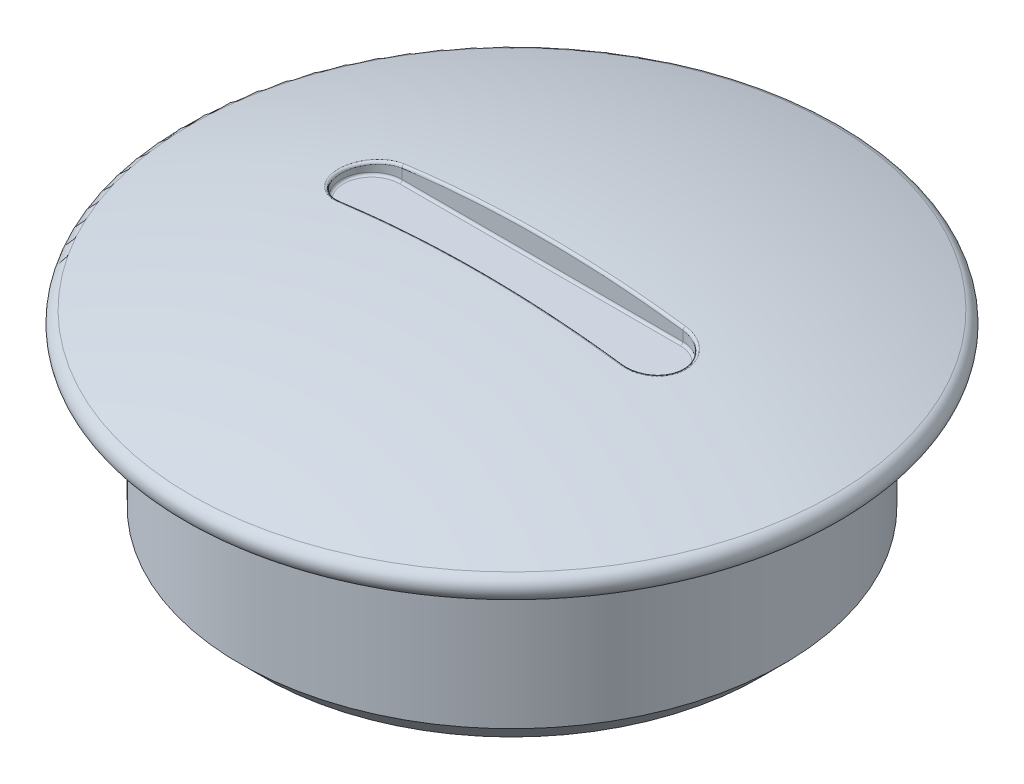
from build123d import *

# Parameters (mm, degrees)
ENL_V_MAT_EXTRU_1_DEPTH = 1
CONG_1_R                = 0.1
CHANFREIN1_SIZE         = 1


with BuildPart() as part:
    # Esquisse1 → R_volution1 (revolve)
    with BuildSketch(Plane.XY, mode=Mode.PRIVATE) as r_volution1_sk:
        with BuildLine():
            Line((11.15, 0), (13, 0))
            ThreePointArc((13, 0), (13.494185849, 0.423971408), (13.150289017, 0.976878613))
            ThreePointArc((13.150289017, 0.976878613), (6.652501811, 2.491261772), (0, 3))
            Line((0, 3), (0, 0))
            Line((0, 0), (8.65, 0))
            ThreePointArc((8.65, 0), (9.003553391, -0.146446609), (9.15, -0.5))
            Line((9.15, -0.5), (9.15, -7))
            Line((9.15, -7), (11.15, -7))
            Line((11.15, -7), (11.15, 0))
        make_face()
    revolve(r_volution1_sk.sketch.rotate(Axis((0, -9.31857289, 0), (0, 1, 0)), 90), axis=Axis((0, -9.31857289, 0), (0, 1, 0)))

    # Esquisse2 → Enl_v. mat.-Extru.1 (cut)
    with BuildSketch(Plane(origin=(0, 3, 0), x_dir=(-1, 0, 0), z_dir=(0, 1, 0))):
        with BuildLine():
            Line((-5.75, 1.25), (5.75, 1.25))
            ThreePointArc((5.75, 1.25), (7, 0), (5.75, -1.25))
            Line((5.75, -1.25), (-5.75, -1.25))
            ThreePointArc((-5.75, -1.25), (-7, 0), (-5.75, 1.25))
        make_face()
    extrude(amount=-ENL_V_MAT_EXTRU_1_DEPTH, mode=Mode.SUBTRACT)

    # Cong_1
    cong_1_edges = [part.edges().sort_by_distance(p)[0] for p in [
        (-2.881260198, 2.88712112, -1.25),
        (-7, 2.436369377, 0),
        (0, 2.982139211, 1.25),
        (7, 2.436369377, 0),
        (7, 2, 0),
        (0, 2, 1.25),
        (-7, 2, 0),
        (0, 2, -1.25),
    ]]
    fillet(cong_1_edges, radius=CONG_1_R)

    # Chanfrein1
    chanfrein1_edges = [part.edges().sort_by_distance(p)[0] for p in [
        (0, -7, 11.15),
    ]]
    chamfer(chanfrein1_edges, length=CHANFREIN1_SIZE)


solid = part.part
